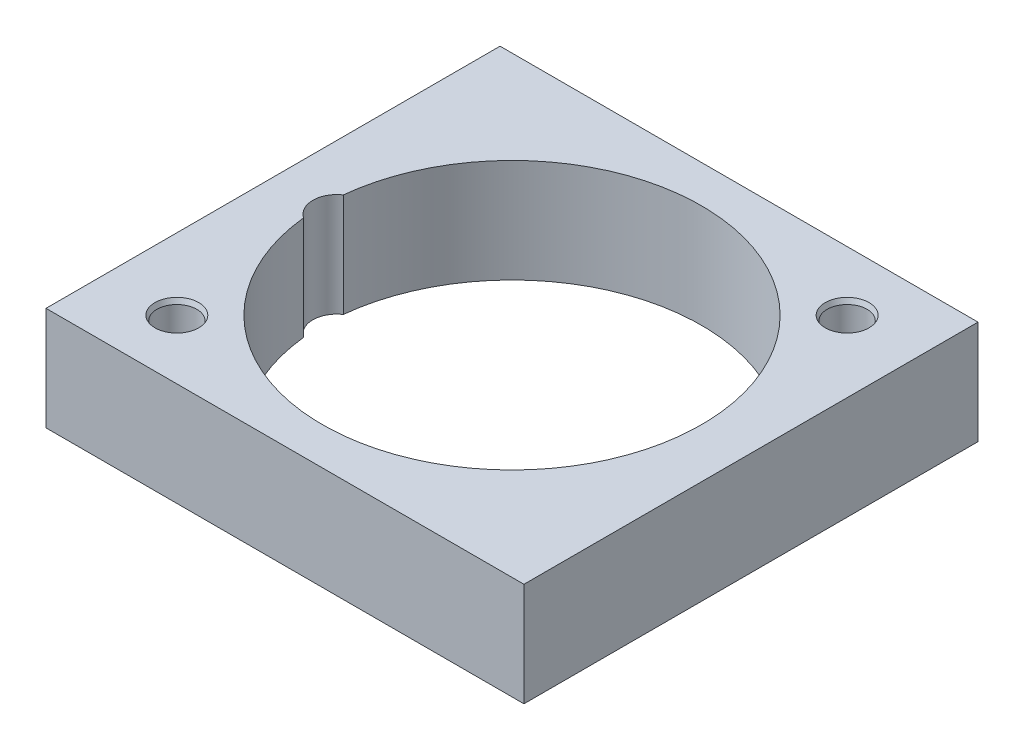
from build123d import *

# Parameters (mm, degrees)
ESQUISSE1_W                  = 60
ESQUISSE1_H                  = 57
BASE_EXTRUSION_DEPTH         = 13
R_P_TITION_CIRCULAIRE1_COUNT = 2


with BuildPart() as part:
    # Esquisse1 → Base-Extrusion (new body)
    with BuildSketch(Plane(origin=(0, 0, 0), x_dir=(1, 0, 0), z_dir=(0, 1, 0))):
        Rectangle(ESQUISSE1_W, ESQUISSE1_H)
        with BuildLine():
            ThreePointArc((-23.669090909, 2.492816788), (23.8, 0), (-23.669090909, -2.492816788))
            ThreePointArc((-23.669090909, -2.492816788), (-25, 0), (-23.669090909, 2.492816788))
        make_face(mode=Mode.SUBTRACT)
    extrude(amount=BASE_EXTRUSION_DEPTH)

    # Esquisse6 → D_gagement pour M51 (revolve, cut)
    with BuildSketch(Plane(origin=(21.03642674, 13, -21.03642674), x_dir=(0, 0, 1), z_dir=(1, 0, 0))):
        Polygon((0, 0), (0, 9.502151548), (2.5, 8), (2.5, 0.603553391), (2.75, 0), align=None)
    d_gagement_pour_m51 = revolve(axis=Axis((21.03642674, 19.35, -21.03642674), (0, -1, 0)), mode=Mode.SUBTRACT)

    # R_p_tition circulaire1: D_gagement pour M51 ×2 about axis
    r_p_tition_circulaire1_axis = Axis((0, 0, 0), (0, 1, 0))
    for i in range(1, R_P_TITION_CIRCULAIRE1_COUNT):
        add(d_gagement_pour_m51.rotate(r_p_tition_circulaire1_axis, i * 360 / R_P_TITION_CIRCULAIRE1_COUNT), mode=Mode.SUBTRACT)


solid = part.part
